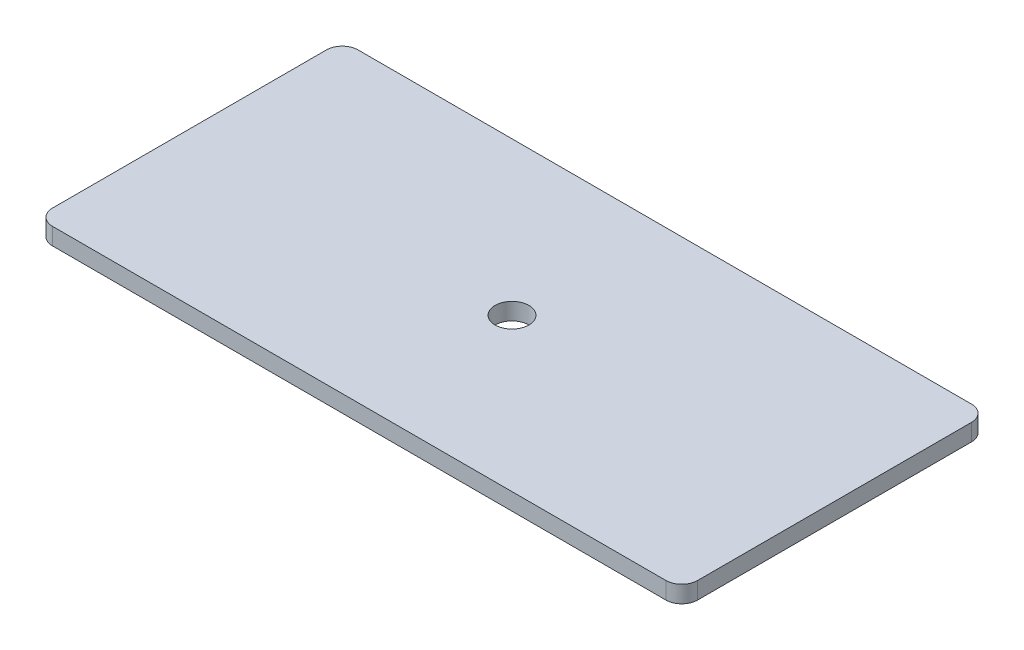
ISO-10303-21;
HEADER;
FILE_DESCRIPTION(('STEP AP214'),'2;1');
FILE_NAME('part.step','',(''),(''),'','','');
FILE_SCHEMA(('AUTOMOTIVE_DESIGN { 1 0 10303 214 1 1 1 1 }'));
ENDSEC;
DATA;
#1=APPLICATION_CONTEXT('core data for automotive mechanical design processes');
#2=APPLICATION_PROTOCOL_DEFINITION('international standard','automotive_design',2000,#1);
#3=PRODUCT_CONTEXT('',#1,'mechanical');
#4=PRODUCT('Part','Part','',(#3));
#5=PRODUCT_RELATED_PRODUCT_CATEGORY('part','',(#4));
#6=PRODUCT_DEFINITION_FORMATION('','',#4);
#7=PRODUCT_DEFINITION_CONTEXT('part definition',#1,'design');
#8=PRODUCT_DEFINITION('design','',#6,#7);
#9=PRODUCT_DEFINITION_SHAPE('','',#8);
#10=(LENGTH_UNIT() NAMED_UNIT(*) SI_UNIT(.MILLI.,.METRE.));
#11=(NAMED_UNIT(*) PLANE_ANGLE_UNIT() SI_UNIT($,.RADIAN.));
#12=(NAMED_UNIT(*) SI_UNIT($,.STERADIAN.) SOLID_ANGLE_UNIT());
#13=UNCERTAINTY_MEASURE_WITH_UNIT(LENGTH_MEASURE(1.E-05),#10,'distance_accuracy_value','');
#14=(GEOMETRIC_REPRESENTATION_CONTEXT(3) GLOBAL_UNCERTAINTY_ASSIGNED_CONTEXT((#13)) GLOBAL_UNIT_ASSIGNED_CONTEXT((#10,
#11,#12)) REPRESENTATION_CONTEXT('',''));
#15=CARTESIAN_POINT('',(0.,0.,0.));
#16=DIRECTION('',(0.,0.,1.));
#17=DIRECTION('',(1.,0.,0.));
#18=AXIS2_PLACEMENT_3D('',#15,#16,#17);
#19=CARTESIAN_POINT('',(90.3357747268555,5.,-40.3357747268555));
#20=DIRECTION('',(0.,-1.,0.));
#21=DIRECTION('',(0.,0.,-1.));
#22=AXIS2_PLACEMENT_3D('',#19,#20,#21);
#23=CYLINDRICAL_SURFACE('',#22,4.6642252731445);
#24=CARTESIAN_POINT('',(90.3357747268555,0.,-40.3357747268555));
#25=DIRECTION('',(0.,1.,0.));
#26=DIRECTION('',(0.,0.,1.));
#27=AXIS2_PLACEMENT_3D('',#24,#25,#26);
#28=CIRCLE('',#27,4.6642252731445);
#29=CARTESIAN_POINT('',(95.,0.,-40.3357747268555));
#30=VERTEX_POINT('',#29);
#31=CARTESIAN_POINT('',(90.3357747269,0.,-45.));
#32=VERTEX_POINT('',#31);
#33=EDGE_CURVE('E140',#30,#32,#28,.T.);
#34=ORIENTED_EDGE('',*,*,#33,.T.);
#35=DIRECTION('',(0.,-1.,0.));
#36=VECTOR('',#35,1.);
#37=CARTESIAN_POINT('',(90.3357747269,5.,-45.));
#38=LINE('',#37,#36);
#39=CARTESIAN_POINT('',(90.3357747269,5.,-45.));
#40=VERTEX_POINT('',#39);
#41=EDGE_CURVE('E11',#40,#32,#38,.T.);
#42=ORIENTED_EDGE('',*,*,#41,.F.);
#43=CARTESIAN_POINT('',(90.3357747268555,5.,-40.3357747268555));
#44=DIRECTION('',(0.,1.,0.));
#45=DIRECTION('',(0.,0.,1.));
#46=AXIS2_PLACEMENT_3D('',#43,#44,#45);
#47=CIRCLE('',#46,4.6642252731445);
#48=CARTESIAN_POINT('',(95.,5.,-40.3357747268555));
#49=VERTEX_POINT('',#48);
#50=EDGE_CURVE('E163',#49,#40,#47,.T.);
#51=ORIENTED_EDGE('',*,*,#50,.F.);
#52=DIRECTION('',(0.,-1.,0.));
#53=VECTOR('',#52,1.);
#54=CARTESIAN_POINT('',(95.,5.,-40.3357747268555));
#55=LINE('',#54,#53);
#56=EDGE_CURVE('E136',#49,#30,#55,.T.);
#57=ORIENTED_EDGE('',*,*,#56,.T.);
#58=EDGE_LOOP('',(#34,#42,#51,#57));
#59=FACE_BOUND('',#58,.T.);
#60=ADVANCED_FACE('F39',(#59),#23,.T.);
#61=CARTESIAN_POINT('',(90.3357747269,5.,-45.));
#62=DIRECTION('',(0.,0.,1.));
#63=DIRECTION('',(1.,0.,0.));
#64=AXIS2_PLACEMENT_3D('',#61,#62,#63);
#65=PLANE('',#64);
#66=DIRECTION('',(-1.,0.,0.));
#67=VECTOR('',#66,1.);
#68=CARTESIAN_POINT('',(90.3357747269,0.,-45.));
#69=LINE('',#68,#67);
#70=CARTESIAN_POINT('',(-90.3357747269,0.,-45.));
#71=VERTEX_POINT('',#70);
#72=EDGE_CURVE('E144',#32,#71,#69,.T.);
#73=ORIENTED_EDGE('',*,*,#72,.T.);
#74=DIRECTION('',(0.,-1.,0.));
#75=VECTOR('',#74,1.);
#76=CARTESIAN_POINT('',(-90.3357747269,5.,-45.));
#77=LINE('',#76,#75);
#78=CARTESIAN_POINT('',(-90.3357747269,5.,-45.));
#79=VERTEX_POINT('',#78);
#80=EDGE_CURVE('E48',#79,#71,#77,.T.);
#81=ORIENTED_EDGE('',*,*,#80,.F.);
#82=DIRECTION('',(-1.,0.,0.));
#83=VECTOR('',#82,1.);
#84=CARTESIAN_POINT('',(90.3357747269,5.,-45.));
#85=LINE('',#84,#83);
#86=EDGE_CURVE('E99',#40,#79,#85,.T.);
#87=ORIENTED_EDGE('',*,*,#86,.F.);
#88=ORIENTED_EDGE('',*,*,#41,.T.);
#89=EDGE_LOOP('',(#73,#81,#87,#88));
#90=FACE_BOUND('',#89,.T.);
#91=ADVANCED_FACE('F232',(#90),#65,.F.);
#92=CARTESIAN_POINT('',(-90.3357747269,5.,-40.3357747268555));
#93=DIRECTION('',(0.,-1.,0.));
#94=DIRECTION('',(0.,0.,-1.));
#95=AXIS2_PLACEMENT_3D('',#92,#93,#94);
#96=CYLINDRICAL_SURFACE('',#95,4.66422527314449);
#97=CARTESIAN_POINT('',(-90.3357747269,0.,-40.3357747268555));
#98=DIRECTION('',(0.,1.,0.));
#99=DIRECTION('',(0.,0.,1.));
#100=AXIS2_PLACEMENT_3D('',#97,#98,#99);
#101=CIRCLE('',#100,4.66422527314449);
#102=CARTESIAN_POINT('',(-95.0000000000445,0.,-40.3357747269));
#103=VERTEX_POINT('',#102);
#104=EDGE_CURVE('E148',#71,#103,#101,.T.);
#105=ORIENTED_EDGE('',*,*,#104,.T.);
#106=DIRECTION('',(0.,-1.,0.));
#107=VECTOR('',#106,1.);
#108=CARTESIAN_POINT('',(-95.0000000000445,5.,-40.3357747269));
#109=LINE('',#108,#107);
#110=CARTESIAN_POINT('',(-95.0000000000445,5.,-40.3357747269));
#111=VERTEX_POINT('',#110);
#112=EDGE_CURVE('E174',#111,#103,#109,.T.);
#113=ORIENTED_EDGE('',*,*,#112,.F.);
#114=CARTESIAN_POINT('',(-90.3357747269,5.,-40.3357747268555));
#115=DIRECTION('',(0.,1.,0.));
#116=DIRECTION('',(0.,0.,1.));
#117=AXIS2_PLACEMENT_3D('',#114,#115,#116);
#118=CIRCLE('',#117,4.66422527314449);
#119=EDGE_CURVE('E184',#79,#111,#118,.T.);
#120=ORIENTED_EDGE('',*,*,#119,.F.);
#121=ORIENTED_EDGE('',*,*,#80,.T.);
#122=EDGE_LOOP('',(#105,#113,#120,#121));
#123=FACE_BOUND('',#122,.T.);
#124=ADVANCED_FACE('F182',(#123),#96,.T.);
#125=CARTESIAN_POINT('',(-95.0000000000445,5.,-40.3357747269));
#126=DIRECTION('',(1.,0.,0.));
#127=DIRECTION('',(0.,0.,-1.));
#128=AXIS2_PLACEMENT_3D('',#125,#126,#127);
#129=PLANE('',#128);
#130=DIRECTION('',(0.,0.,1.));
#131=VECTOR('',#130,1.);
#132=CARTESIAN_POINT('',(-95.0000000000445,0.,-40.3357747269));
#133=LINE('',#132,#131);
#134=CARTESIAN_POINT('',(-95.0000000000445,0.,40.3357747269));
#135=VERTEX_POINT('',#134);
#136=EDGE_CURVE('E151',#103,#135,#133,.T.);
#137=ORIENTED_EDGE('',*,*,#136,.T.);
#138=DIRECTION('',(0.,-1.,0.));
#139=VECTOR('',#138,1.);
#140=CARTESIAN_POINT('',(-95.0000000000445,5.,40.3357747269));
#141=LINE('',#140,#139);
#142=CARTESIAN_POINT('',(-95.0000000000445,5.,40.3357747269));
#143=VERTEX_POINT('',#142);
#144=EDGE_CURVE('E170',#143,#135,#141,.T.);
#145=ORIENTED_EDGE('',*,*,#144,.F.);
#146=DIRECTION('',(0.,0.,1.));
#147=VECTOR('',#146,1.);
#148=CARTESIAN_POINT('',(-95.0000000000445,5.,-40.3357747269));
#149=LINE('',#148,#147);
#150=EDGE_CURVE('E197',#111,#143,#149,.T.);
#151=ORIENTED_EDGE('',*,*,#150,.F.);
#152=ORIENTED_EDGE('',*,*,#112,.T.);
#153=EDGE_LOOP('',(#137,#145,#151,#152));
#154=FACE_BOUND('',#153,.T.);
#155=ADVANCED_FACE('F192',(#154),#129,.F.);
#156=CARTESIAN_POINT('',(-90.3357747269,5.,40.3357747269));
#157=DIRECTION('',(0.,-1.,0.));
#158=DIRECTION('',(0.,0.,-1.));
#159=AXIS2_PLACEMENT_3D('',#156,#157,#158);
#160=CYLINDRICAL_SURFACE('',#159,4.66422527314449);
#161=CARTESIAN_POINT('',(-90.3357747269,0.,40.3357747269));
#162=DIRECTION('',(0.,1.,0.));
#163=DIRECTION('',(0.,0.,1.));
#164=AXIS2_PLACEMENT_3D('',#161,#162,#163);
#165=CIRCLE('',#164,4.66422527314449);
#166=CARTESIAN_POINT('',(-90.3357747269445,0.,45.0000000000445));
#167=VERTEX_POINT('',#166);
#168=EDGE_CURVE('E154',#135,#167,#165,.T.);
#169=ORIENTED_EDGE('',*,*,#168,.T.);
#170=DIRECTION('',(0.,-1.,0.));
#171=VECTOR('',#170,1.);
#172=CARTESIAN_POINT('',(-90.3357747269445,5.,45.0000000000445));
#173=LINE('',#172,#171);
#174=CARTESIAN_POINT('',(-90.3357747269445,5.,45.0000000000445));
#175=VERTEX_POINT('',#174);
#176=EDGE_CURVE('E129',#175,#167,#173,.T.);
#177=ORIENTED_EDGE('',*,*,#176,.F.);
#178=CARTESIAN_POINT('',(-90.3357747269,5.,40.3357747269));
#179=DIRECTION('',(0.,1.,0.));
#180=DIRECTION('',(0.,0.,1.));
#181=AXIS2_PLACEMENT_3D('',#178,#179,#180);
#182=CIRCLE('',#181,4.66422527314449);
#183=EDGE_CURVE('E118',#143,#175,#182,.T.);
#184=ORIENTED_EDGE('',*,*,#183,.F.);
#185=ORIENTED_EDGE('',*,*,#144,.T.);
#186=EDGE_LOOP('',(#169,#177,#184,#185));
#187=FACE_BOUND('',#186,.T.);
#188=ADVANCED_FACE('F195',(#187),#160,.T.);
#189=CARTESIAN_POINT('',(-90.3357747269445,5.,45.0000000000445));
#190=DIRECTION('',(0.,0.,-1.));
#191=DIRECTION('',(-1.,0.,0.));
#192=AXIS2_PLACEMENT_3D('',#189,#190,#191);
#193=PLANE('',#192);
#194=DIRECTION('',(1.,0.,0.));
#195=VECTOR('',#194,1.);
#196=CARTESIAN_POINT('',(-90.3357747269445,0.,45.0000000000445));
#197=LINE('',#196,#195);
#198=CARTESIAN_POINT('',(90.3357747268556,0.,45.0000000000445));
#199=VERTEX_POINT('',#198);
#200=EDGE_CURVE('E127',#167,#199,#197,.T.);
#201=ORIENTED_EDGE('',*,*,#200,.T.);
#202=DIRECTION('',(0.,-1.,0.));
#203=VECTOR('',#202,1.);
#204=CARTESIAN_POINT('',(90.3357747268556,5.,45.0000000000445));
#205=LINE('',#204,#203);
#206=CARTESIAN_POINT('',(90.3357747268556,5.,45.0000000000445));
#207=VERTEX_POINT('',#206);
#208=EDGE_CURVE('E124',#207,#199,#205,.T.);
#209=ORIENTED_EDGE('',*,*,#208,.F.);
#210=DIRECTION('',(1.,0.,0.));
#211=VECTOR('',#210,1.);
#212=CARTESIAN_POINT('',(-90.3357747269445,5.,45.0000000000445));
#213=LINE('',#212,#211);
#214=EDGE_CURVE('E112',#175,#207,#213,.T.);
#215=ORIENTED_EDGE('',*,*,#214,.F.);
#216=ORIENTED_EDGE('',*,*,#176,.T.);
#217=EDGE_LOOP('',(#201,#209,#215,#216));
#218=FACE_BOUND('',#217,.T.);
#219=ADVANCED_FACE('F125',(#218),#193,.F.);
#220=CARTESIAN_POINT('',(90.3357747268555,5.,40.3357747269));
#221=DIRECTION('',(0.,-1.,0.));
#222=DIRECTION('',(0.,0.,-1.));
#223=AXIS2_PLACEMENT_3D('',#220,#221,#222);
#224=CYLINDRICAL_SURFACE('',#223,4.66422527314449);
#225=CARTESIAN_POINT('',(90.3357747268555,0.,40.3357747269));
#226=DIRECTION('',(0.,1.,0.));
#227=DIRECTION('',(0.,0.,1.));
#228=AXIS2_PLACEMENT_3D('',#225,#226,#227);
#229=CIRCLE('',#228,4.66422527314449);
#230=CARTESIAN_POINT('',(95.,0.,40.3357747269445));
#231=VERTEX_POINT('',#230);
#232=EDGE_CURVE('E85',#199,#231,#229,.T.);
#233=ORIENTED_EDGE('',*,*,#232,.T.);
#234=DIRECTION('',(0.,-1.,0.));
#235=VECTOR('',#234,1.);
#236=CARTESIAN_POINT('',(95.,5.,40.3357747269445));
#237=LINE('',#236,#235);
#238=CARTESIAN_POINT('',(95.,5.,40.3357747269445));
#239=VERTEX_POINT('',#238);
#240=EDGE_CURVE('E130',#239,#231,#237,.T.);
#241=ORIENTED_EDGE('',*,*,#240,.F.);
#242=CARTESIAN_POINT('',(90.3357747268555,5.,40.3357747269));
#243=DIRECTION('',(0.,1.,0.));
#244=DIRECTION('',(0.,0.,1.));
#245=AXIS2_PLACEMENT_3D('',#242,#243,#244);
#246=CIRCLE('',#245,4.66422527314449);
#247=EDGE_CURVE('E116',#207,#239,#246,.T.);
#248=ORIENTED_EDGE('',*,*,#247,.F.);
#249=ORIENTED_EDGE('',*,*,#208,.T.);
#250=EDGE_LOOP('',(#233,#241,#248,#249));
#251=FACE_BOUND('',#250,.T.);
#252=ADVANCED_FACE('F132',(#251),#224,.T.);
#253=CARTESIAN_POINT('',(95.,5.,40.3357747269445));
#254=DIRECTION('',(-1.,0.,0.));
#255=DIRECTION('',(0.,0.,1.));
#256=AXIS2_PLACEMENT_3D('',#253,#254,#255);
#257=PLANE('',#256);
#258=DIRECTION('',(0.,0.,-1.));
#259=VECTOR('',#258,1.);
#260=CARTESIAN_POINT('',(95.,0.,40.3357747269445));
#261=LINE('',#260,#259);
#262=EDGE_CURVE('E91',#231,#30,#261,.T.);
#263=ORIENTED_EDGE('',*,*,#262,.T.);
#264=ORIENTED_EDGE('',*,*,#56,.F.);
#265=DIRECTION('',(0.,0.,-1.));
#266=VECTOR('',#265,1.);
#267=CARTESIAN_POINT('',(95.,5.,40.3357747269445));
#268=LINE('',#267,#266);
#269=EDGE_CURVE('E56',#239,#49,#268,.T.);
#270=ORIENTED_EDGE('',*,*,#269,.F.);
#271=ORIENTED_EDGE('',*,*,#240,.T.);
#272=EDGE_LOOP('',(#263,#264,#270,#271));
#273=FACE_BOUND('',#272,.T.);
#274=ADVANCED_FACE('F223',(#273),#257,.F.);
#275=CARTESIAN_POINT('',(90.3357747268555,5.,-40.3357747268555));
#276=DIRECTION('',(0.,1.,0.));
#277=DIRECTION('',(0.,0.,1.));
#278=AXIS2_PLACEMENT_3D('',#275,#276,#277);
#279=PLANE('',#278);
#280=CARTESIAN_POINT('',(0.,5.,0.));
#281=DIRECTION('',(0.,1.,0.));
#282=DIRECTION('',(0.,0.,1.));
#283=AXIS2_PLACEMENT_3D('',#280,#281,#282);
#284=CIRCLE('',#283,5.);
#285=CARTESIAN_POINT('',(0.,5.,5.));
#286=VERTEX_POINT('',#285);
#287=EDGE_CURVE('E207',#286,#286,#284,.T.);
#288=ORIENTED_EDGE('',*,*,#287,.F.);
#289=EDGE_LOOP('',(#288));
#290=FACE_BOUND('',#289,.T.);
#291=ORIENTED_EDGE('',*,*,#50,.T.);
#292=ORIENTED_EDGE('',*,*,#86,.T.);
#293=ORIENTED_EDGE('',*,*,#119,.T.);
#294=ORIENTED_EDGE('',*,*,#150,.T.);
#295=ORIENTED_EDGE('',*,*,#183,.T.);
#296=ORIENTED_EDGE('',*,*,#214,.T.);
#297=ORIENTED_EDGE('',*,*,#247,.T.);
#298=ORIENTED_EDGE('',*,*,#269,.T.);
#299=EDGE_LOOP('',(#291,#292,#293,#294,#295,#296,#297,#298));
#300=FACE_BOUND('',#299,.T.);
#301=ADVANCED_FACE('F114',(#290,#300),#279,.T.);
#302=CARTESIAN_POINT('',(90.3357747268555,0.,-40.3357747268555));
#303=DIRECTION('',(0.,1.,0.));
#304=DIRECTION('',(0.,0.,1.));
#305=AXIS2_PLACEMENT_3D('',#302,#303,#304);
#306=PLANE('',#305);
#307=CARTESIAN_POINT('',(0.,0.,0.));
#308=DIRECTION('',(0.,1.,0.));
#309=DIRECTION('',(0.,0.,1.));
#310=AXIS2_PLACEMENT_3D('',#307,#308,#309);
#311=CIRCLE('',#310,5.);
#312=CARTESIAN_POINT('',(0.,0.,5.));
#313=VERTEX_POINT('',#312);
#314=EDGE_CURVE('E145',#313,#313,#311,.T.);
#315=ORIENTED_EDGE('',*,*,#314,.T.);
#316=EDGE_LOOP('',(#315));
#317=FACE_BOUND('',#316,.T.);
#318=ORIENTED_EDGE('',*,*,#33,.F.);
#319=ORIENTED_EDGE('',*,*,#262,.F.);
#320=ORIENTED_EDGE('',*,*,#232,.F.);
#321=ORIENTED_EDGE('',*,*,#200,.F.);
#322=ORIENTED_EDGE('',*,*,#168,.F.);
#323=ORIENTED_EDGE('',*,*,#136,.F.);
#324=ORIENTED_EDGE('',*,*,#104,.F.);
#325=ORIENTED_EDGE('',*,*,#72,.F.);
#326=EDGE_LOOP('',(#318,#319,#320,#321,#322,#323,#324,#325));
#327=FACE_BOUND('',#326,.T.);
#328=ADVANCED_FACE('F188',(#317,#327),#306,.F.);
#329=CARTESIAN_POINT('',(0.,0.,0.));
#330=DIRECTION('',(0.,1.,0.));
#331=DIRECTION('',(0.,0.,1.));
#332=AXIS2_PLACEMENT_3D('',#329,#330,#331);
#333=CYLINDRICAL_SURFACE('',#332,5.);
#334=ORIENTED_EDGE('',*,*,#314,.F.);
#335=EDGE_LOOP('',(#334));
#336=FACE_BOUND('',#335,.T.);
#337=ORIENTED_EDGE('',*,*,#287,.T.);
#338=EDGE_LOOP('',(#337));
#339=FACE_BOUND('',#338,.T.);
#340=ADVANCED_FACE('F216',(#336,#339),#333,.F.);
#341=CLOSED_SHELL('',(#60,#91,#124,#155,#188,#219,#252,#274,#301,#328,#340));
#342=MANIFOLD_SOLID_BREP('B2',#341);
#343=ADVANCED_BREP_SHAPE_REPRESENTATION('',(#18,#342),#14);
#344=SHAPE_DEFINITION_REPRESENTATION(#9,#343);
ENDSEC;
END-ISO-10303-21;
